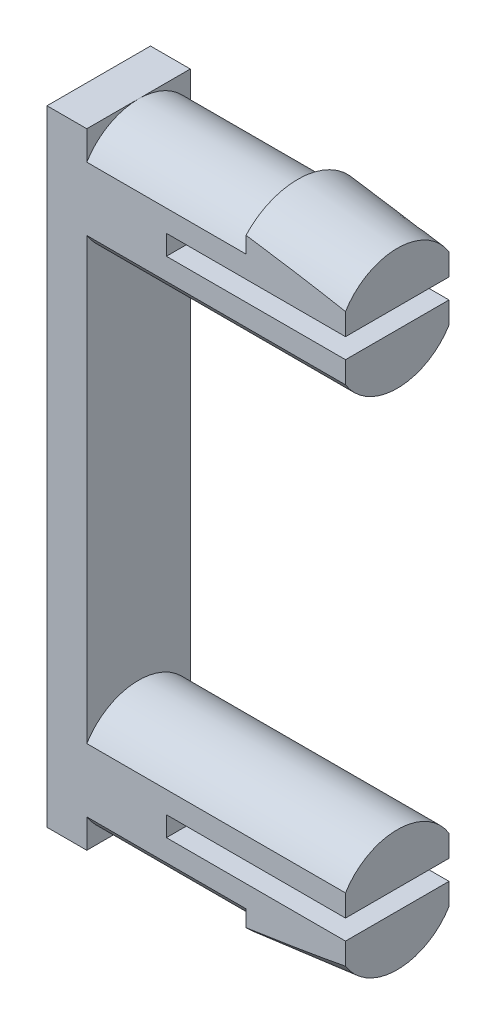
ISO-10303-21;
HEADER;
FILE_DESCRIPTION(('STEP AP214'),'2;1');
FILE_NAME('part.step','',(''),(''),'','','');
FILE_SCHEMA(('AUTOMOTIVE_DESIGN { 1 0 10303 214 1 1 1 1 }'));
ENDSEC;
DATA;
#1=APPLICATION_CONTEXT('core data for automotive mechanical design processes');
#2=APPLICATION_PROTOCOL_DEFINITION('international standard','automotive_design',2000,#1);
#3=PRODUCT_CONTEXT('',#1,'mechanical');
#4=PRODUCT('Part','Part','',(#3));
#5=PRODUCT_RELATED_PRODUCT_CATEGORY('part','',(#4));
#6=PRODUCT_DEFINITION_FORMATION('','',#4);
#7=PRODUCT_DEFINITION_CONTEXT('part definition',#1,'design');
#8=PRODUCT_DEFINITION('design','',#6,#7);
#9=PRODUCT_DEFINITION_SHAPE('','',#8);
#10=(LENGTH_UNIT() NAMED_UNIT(*) SI_UNIT(.MILLI.,.METRE.));
#11=(NAMED_UNIT(*) PLANE_ANGLE_UNIT() SI_UNIT($,.RADIAN.));
#12=(NAMED_UNIT(*) SI_UNIT($,.STERADIAN.) SOLID_ANGLE_UNIT());
#13=UNCERTAINTY_MEASURE_WITH_UNIT(LENGTH_MEASURE(1.E-05),#10,'distance_accuracy_value','');
#14=(GEOMETRIC_REPRESENTATION_CONTEXT(3) GLOBAL_UNCERTAINTY_ASSIGNED_CONTEXT((#13)) GLOBAL_UNIT_ASSIGNED_CONTEXT((#10,
#11,#12)) REPRESENTATION_CONTEXT('',''));
#15=CARTESIAN_POINT('',(0.,0.,0.));
#16=DIRECTION('',(0.,0.,1.));
#17=DIRECTION('',(1.,0.,0.));
#18=AXIS2_PLACEMENT_3D('',#15,#16,#17);
#19=CARTESIAN_POINT('',(14.,-12.65,12.65));
#20=DIRECTION('',(1.,0.,0.));
#21=DIRECTION('',(0.,1.,0.));
#22=AXIS2_PLACEMENT_3D('',#19,#20,#21);
#23=PLANE('',#22);
#24=DIRECTION('',(0.,0.,-1.));
#25=VECTOR('',#24,1.);
#26=CARTESIAN_POINT('',(14.,-12.15,2.60100000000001));
#27=LINE('',#26,#25);
#28=CARTESIAN_POINT('',(14.,-12.15,2.59999999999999));
#29=VERTEX_POINT('',#28);
#30=CARTESIAN_POINT('',(14.,-12.15,-2.59999999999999));
#31=VERTEX_POINT('',#30);
#32=EDGE_CURVE('E211',#29,#31,#27,.T.);
#33=ORIENTED_EDGE('',*,*,#32,.T.);
#34=DIRECTION('',(0.,-1.,0.));
#35=VECTOR('',#34,1.);
#36=CARTESIAN_POINT('',(14.,0.,-2.6));
#37=LINE('',#36,#35);
#38=CARTESIAN_POINT('',(14.,-11.0554781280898,-2.59999999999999));
#39=VERTEX_POINT('',#38);
#40=EDGE_CURVE('E389',#39,#31,#37,.T.);
#41=ORIENTED_EDGE('',*,*,#40,.F.);
#42=CARTESIAN_POINT('',(14.,-12.65,0.));
#43=DIRECTION('',(-1.,0.,0.));
#44=DIRECTION('',(0.,-1.,0.));
#45=AXIS2_PLACEMENT_3D('',#42,#43,#44);
#46=CIRCLE('',#45,3.05);
#47=CARTESIAN_POINT('',(14.,-11.0554781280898,2.59999999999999));
#48=VERTEX_POINT('',#47);
#49=EDGE_CURVE('E330',#48,#39,#46,.T.);
#50=ORIENTED_EDGE('',*,*,#49,.F.);
#51=DIRECTION('',(0.,-1.,0.));
#52=VECTOR('',#51,1.);
#53=CARTESIAN_POINT('',(14.,0.,2.6));
#54=LINE('',#53,#52);
#55=EDGE_CURVE('E226',#48,#29,#54,.T.);
#56=ORIENTED_EDGE('',*,*,#55,.T.);
#57=EDGE_LOOP('',(#33,#41,#50,#56));
#58=FACE_BOUND('',#57,.T.);
#59=ADVANCED_FACE('F37',(#58),#23,.T.);
#60=CARTESIAN_POINT('',(14.,12.65,-12.65));
#61=DIRECTION('',(1.,0.,0.));
#62=DIRECTION('',(0.,1.,0.));
#63=AXIS2_PLACEMENT_3D('',#60,#61,#62);
#64=PLANE('',#63);
#65=DIRECTION('',(0.,0.,-1.));
#66=VECTOR('',#65,1.);
#67=CARTESIAN_POINT('',(14.,13.15,2.601));
#68=LINE('',#67,#66);
#69=CARTESIAN_POINT('',(14.,13.15,2.6));
#70=VERTEX_POINT('',#69);
#71=CARTESIAN_POINT('',(14.,13.15,-2.6));
#72=VERTEX_POINT('',#71);
#73=EDGE_CURVE('E434',#70,#72,#68,.T.);
#74=ORIENTED_EDGE('',*,*,#73,.T.);
#75=CARTESIAN_POINT('',(14.,14.2445218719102,-2.6));
#76=VERTEX_POINT('',#75);
#77=EDGE_CURVE('E382',#76,#72,#37,.T.);
#78=ORIENTED_EDGE('',*,*,#77,.F.);
#79=CARTESIAN_POINT('',(14.,12.65,0.));
#80=DIRECTION('',(-1.,0.,0.));
#81=DIRECTION('',(0.,-1.,0.));
#82=AXIS2_PLACEMENT_3D('',#79,#80,#81);
#83=CIRCLE('',#82,3.05);
#84=CARTESIAN_POINT('',(14.,14.2445218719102,2.6));
#85=VERTEX_POINT('',#84);
#86=EDGE_CURVE('E320',#85,#76,#83,.T.);
#87=ORIENTED_EDGE('',*,*,#86,.F.);
#88=EDGE_CURVE('E231',#85,#70,#54,.T.);
#89=ORIENTED_EDGE('',*,*,#88,.T.);
#90=EDGE_LOOP('',(#74,#78,#87,#89));
#91=FACE_BOUND('',#90,.T.);
#92=ADVANCED_FACE('F498',(#91),#64,.T.);
#93=CARTESIAN_POINT('',(0.999999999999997,12.65,0.));
#94=DIRECTION('',(-1.,0.,0.));
#95=DIRECTION('',(0.,-1.,0.));
#96=AXIS2_PLACEMENT_3D('',#93,#94,#95);
#97=CYLINDRICAL_SURFACE('',#96,3.05);
#98=DIRECTION('',(-1.,0.,0.));
#99=VECTOR('',#98,1.);
#100=CARTESIAN_POINT('',(0.999999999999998,11.0554781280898,2.6));
#101=LINE('',#100,#99);
#102=CARTESIAN_POINT('',(0.999999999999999,11.0554781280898,2.6));
#103=VERTEX_POINT('',#102);
#104=CARTESIAN_POINT('',(14.,11.0554781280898,2.6));
#105=VERTEX_POINT('',#104);
#106=EDGE_CURVE('E388',#103,#105,#101,.F.);
#107=ORIENTED_EDGE('',*,*,#106,.F.);
#108=CARTESIAN_POINT('',(0.999999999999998,12.65,0.));
#109=DIRECTION('',(-1.,0.,0.));
#110=DIRECTION('',(0.,-1.,0.));
#111=AXIS2_PLACEMENT_3D('',#108,#109,#110);
#112=CIRCLE('',#111,3.05);
#113=CARTESIAN_POINT('',(0.999999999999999,11.0554781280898,-2.6));
#114=VERTEX_POINT('',#113);
#115=EDGE_CURVE('E324',#114,#103,#112,.T.);
#116=ORIENTED_EDGE('',*,*,#115,.F.);
#117=DIRECTION('',(-1.,0.,0.));
#118=VECTOR('',#117,1.);
#119=CARTESIAN_POINT('',(0.999999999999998,11.0554781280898,-2.6));
#120=LINE('',#119,#118);
#121=CARTESIAN_POINT('',(14.,11.0554781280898,-2.6));
#122=VERTEX_POINT('',#121);
#123=EDGE_CURVE('E361',#114,#122,#120,.F.);
#124=ORIENTED_EDGE('',*,*,#123,.T.);
#125=CARTESIAN_POINT('',(14.,12.65,0.));
#126=DIRECTION('',(-1.,0.,0.));
#127=DIRECTION('',(0.,-1.,0.));
#128=AXIS2_PLACEMENT_3D('',#125,#126,#127);
#129=CIRCLE('',#128,3.05);
#130=EDGE_CURVE('E327',#122,#105,#129,.T.);
#131=ORIENTED_EDGE('',*,*,#130,.T.);
#132=EDGE_LOOP('',(#107,#116,#124,#131));
#133=FACE_BOUND('',#132,.T.);
#134=ADVANCED_FACE('F446',(#133),#97,.T.);
#135=CARTESIAN_POINT('',(1.,-12.65,0.));
#136=DIRECTION('',(-1.,0.,0.));
#137=DIRECTION('',(0.,-1.,0.));
#138=AXIS2_PLACEMENT_3D('',#135,#136,#137);
#139=CYLINDRICAL_SURFACE('',#138,3.05);
#140=DIRECTION('',(-1.,0.,0.));
#141=VECTOR('',#140,1.);
#142=CARTESIAN_POINT('',(1.,-14.2445218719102,2.59999999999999));
#143=LINE('',#142,#141);
#144=CARTESIAN_POINT('',(1.,-14.2445218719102,2.59999999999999));
#145=VERTEX_POINT('',#144);
#146=CARTESIAN_POINT('',(9.,-14.2445218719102,2.59999999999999));
#147=VERTEX_POINT('',#146);
#148=EDGE_CURVE('E801',#145,#147,#143,.F.);
#149=ORIENTED_EDGE('',*,*,#148,.F.);
#150=CARTESIAN_POINT('',(1.,-12.65,0.));
#151=DIRECTION('',(-1.,0.,0.));
#152=DIRECTION('',(0.,-1.,0.));
#153=AXIS2_PLACEMENT_3D('',#150,#151,#152);
#154=CIRCLE('',#153,3.05);
#155=CARTESIAN_POINT('',(1.,-15.7,0.));
#156=VERTEX_POINT('',#155);
#157=EDGE_CURVE('E340',#156,#145,#154,.T.);
#158=ORIENTED_EDGE('',*,*,#157,.F.);
#159=CARTESIAN_POINT('',(1.,-14.2445218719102,-2.59999999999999));
#160=VERTEX_POINT('',#159);
#161=EDGE_CURVE('E339',#160,#156,#154,.T.);
#162=ORIENTED_EDGE('',*,*,#161,.F.);
#163=DIRECTION('',(-1.,0.,0.));
#164=VECTOR('',#163,1.);
#165=CARTESIAN_POINT('',(1.,-14.2445218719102,-2.59999999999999));
#166=LINE('',#165,#164);
#167=CARTESIAN_POINT('',(9.,-14.2445218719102,-2.59999999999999));
#168=VERTEX_POINT('',#167);
#169=EDGE_CURVE('E373',#160,#168,#166,.F.);
#170=ORIENTED_EDGE('',*,*,#169,.T.);
#171=CARTESIAN_POINT('',(9.,-12.65,0.));
#172=DIRECTION('',(-1.,0.,0.));
#173=DIRECTION('',(0.,-1.,0.));
#174=AXIS2_PLACEMENT_3D('',#171,#172,#173);
#175=CIRCLE('',#174,3.05);
#176=EDGE_CURVE('E343',#168,#147,#175,.T.);
#177=ORIENTED_EDGE('',*,*,#176,.T.);
#178=EDGE_LOOP('',(#149,#158,#162,#170,#177));
#179=FACE_BOUND('',#178,.T.);
#180=ADVANCED_FACE('F460',(#179),#139,.T.);
#181=CARTESIAN_POINT('',(1.,0.,3.));
#182=DIRECTION('',(1.,0.,0.));
#183=DIRECTION('',(0.,1.,0.));
#184=AXIS2_PLACEMENT_3D('',#181,#182,#183);
#185=PLANE('',#184);
#186=DIRECTION('',(0.,0.,-1.));
#187=VECTOR('',#186,1.);
#188=CARTESIAN_POINT('',(1.,-15.7,3.));
#189=LINE('',#188,#187);
#190=CARTESIAN_POINT('',(1.,-15.7,-2.6));
#191=VERTEX_POINT('',#190);
#192=EDGE_CURVE('E315',#156,#191,#189,.T.);
#193=ORIENTED_EDGE('',*,*,#192,.T.);
#194=DIRECTION('',(0.,1.,0.));
#195=VECTOR('',#194,1.);
#196=CARTESIAN_POINT('',(1.,0.,-2.6));
#197=LINE('',#196,#195);
#198=EDGE_CURVE('E370',#191,#160,#197,.T.);
#199=ORIENTED_EDGE('',*,*,#198,.T.);
#200=ORIENTED_EDGE('',*,*,#161,.T.);
#201=EDGE_LOOP('',(#193,#199,#200));
#202=FACE_BOUND('',#201,.T.);
#203=ADVANCED_FACE('F39',(#202),#185,.T.);
#204=DIRECTION('',(0.,1.,0.));
#205=VECTOR('',#204,1.);
#206=CARTESIAN_POINT('',(1.,0.,2.6));
#207=LINE('',#206,#205);
#208=CARTESIAN_POINT('',(1.,-11.0554781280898,2.59999999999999));
#209=VERTEX_POINT('',#208);
#210=EDGE_CURVE('E393',#209,#103,#207,.T.);
#211=ORIENTED_EDGE('',*,*,#210,.F.);
#212=CARTESIAN_POINT('',(1.,-12.65,0.));
#213=DIRECTION('',(-1.,0.,0.));
#214=DIRECTION('',(0.,-1.,0.));
#215=AXIS2_PLACEMENT_3D('',#212,#213,#214);
#216=CIRCLE('',#215,3.05);
#217=CARTESIAN_POINT('',(1.,-11.0554781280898,-2.59999999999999));
#218=VERTEX_POINT('',#217);
#219=EDGE_CURVE('E332',#209,#218,#216,.T.);
#220=ORIENTED_EDGE('',*,*,#219,.T.);
#221=DIRECTION('',(0.,1.,0.));
#222=VECTOR('',#221,1.);
#223=CARTESIAN_POINT('',(1.,0.,-2.6));
#224=LINE('',#223,#222);
#225=EDGE_CURVE('E364',#218,#114,#224,.T.);
#226=ORIENTED_EDGE('',*,*,#225,.T.);
#227=ORIENTED_EDGE('',*,*,#115,.T.);
#228=EDGE_LOOP('',(#211,#220,#226,#227));
#229=FACE_BOUND('',#228,.T.);
#230=ADVANCED_FACE('F402',(#229),#185,.T.);
#231=CARTESIAN_POINT('',(0.999999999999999,12.65,0.));
#232=DIRECTION('',(-1.,0.,0.));
#233=DIRECTION('',(0.,-1.,0.));
#234=AXIS2_PLACEMENT_3D('',#231,#232,#233);
#235=CIRCLE('',#234,3.05);
#236=CARTESIAN_POINT('',(0.999999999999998,15.7,0.));
#237=VERTEX_POINT('',#236);
#238=CARTESIAN_POINT('',(0.999999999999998,14.2445218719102,-2.6));
#239=VERTEX_POINT('',#238);
#240=EDGE_CURVE('E307',#237,#239,#235,.T.);
#241=ORIENTED_EDGE('',*,*,#240,.T.);
#242=DIRECTION('',(0.,1.,0.));
#243=VECTOR('',#242,1.);
#244=CARTESIAN_POINT('',(1.,0.,-2.6));
#245=LINE('',#244,#243);
#246=CARTESIAN_POINT('',(0.999999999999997,15.7,-2.6));
#247=VERTEX_POINT('',#246);
#248=EDGE_CURVE('E346',#239,#247,#245,.T.);
#249=ORIENTED_EDGE('',*,*,#248,.T.);
#250=DIRECTION('',(0.,0.,-1.));
#251=VECTOR('',#250,1.);
#252=CARTESIAN_POINT('',(0.999999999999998,15.7,3.));
#253=LINE('',#252,#251);
#254=EDGE_CURVE('E308',#237,#247,#253,.T.);
#255=ORIENTED_EDGE('',*,*,#254,.F.);
#256=EDGE_LOOP('',(#241,#249,#255));
#257=FACE_BOUND('',#256,.T.);
#258=ADVANCED_FACE('F483',(#257),#185,.T.);
#259=CARTESIAN_POINT('',(0.,15.7,3.));
#260=DIRECTION('',(0.,1.,0.));
#261=DIRECTION('',(0.,0.,1.));
#262=AXIS2_PLACEMENT_3D('',#259,#260,#261);
#263=PLANE('',#262);
#264=DIRECTION('',(-1.,0.,0.));
#265=VECTOR('',#264,1.);
#266=CARTESIAN_POINT('',(14.,15.7,2.6));
#267=LINE('',#266,#265);
#268=CARTESIAN_POINT('',(0.999999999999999,15.7,2.6));
#269=VERTEX_POINT('',#268);
#270=CARTESIAN_POINT('',(-1.,15.7,2.6));
#271=VERTEX_POINT('',#270);
#272=EDGE_CURVE('E241',#269,#271,#267,.T.);
#273=ORIENTED_EDGE('',*,*,#272,.F.);
#274=EDGE_CURVE('E305',#269,#237,#253,.T.);
#275=ORIENTED_EDGE('',*,*,#274,.T.);
#276=ORIENTED_EDGE('',*,*,#254,.T.);
#277=DIRECTION('',(-1.,0.,0.));
#278=VECTOR('',#277,1.);
#279=CARTESIAN_POINT('',(14.,15.7,-2.6));
#280=LINE('',#279,#278);
#281=CARTESIAN_POINT('',(-1.,15.7,-2.6));
#282=VERTEX_POINT('',#281);
#283=EDGE_CURVE('E379',#247,#282,#280,.T.);
#284=ORIENTED_EDGE('',*,*,#283,.T.);
#285=DIRECTION('',(0.,0.,-1.));
#286=VECTOR('',#285,1.);
#287=CARTESIAN_POINT('',(-1.,15.7,3.));
#288=LINE('',#287,#286);
#289=EDGE_CURVE('E309',#271,#282,#288,.T.);
#290=ORIENTED_EDGE('',*,*,#289,.F.);
#291=EDGE_LOOP('',(#273,#275,#276,#284,#290));
#292=FACE_BOUND('',#291,.T.);
#293=ADVANCED_FACE('F476',(#292),#263,.T.);
#294=CARTESIAN_POINT('',(-1.,0.,3.));
#295=DIRECTION('',(1.,0.,0.));
#296=DIRECTION('',(0.,1.,0.));
#297=AXIS2_PLACEMENT_3D('',#294,#295,#296);
#298=PLANE('',#297);
#299=DIRECTION('',(0.,0.,-1.));
#300=VECTOR('',#299,1.);
#301=CARTESIAN_POINT('',(-0.999999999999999,-15.7,3.));
#302=LINE('',#301,#300);
#303=CARTESIAN_POINT('',(-0.999999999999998,-15.7,2.6));
#304=VERTEX_POINT('',#303);
#305=CARTESIAN_POINT('',(-0.999999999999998,-15.7,-2.6));
#306=VERTEX_POINT('',#305);
#307=EDGE_CURVE('E311',#304,#306,#302,.T.);
#308=ORIENTED_EDGE('',*,*,#307,.F.);
#309=DIRECTION('',(0.,-1.,0.));
#310=VECTOR('',#309,1.);
#311=CARTESIAN_POINT('',(-1.,0.,2.6));
#312=LINE('',#311,#310);
#313=EDGE_CURVE('E227',#271,#304,#312,.T.);
#314=ORIENTED_EDGE('',*,*,#313,.F.);
#315=ORIENTED_EDGE('',*,*,#289,.T.);
#316=DIRECTION('',(0.,-1.,0.));
#317=VECTOR('',#316,1.);
#318=CARTESIAN_POINT('',(-1.,0.,-2.6));
#319=LINE('',#318,#317);
#320=EDGE_CURVE('E385',#282,#306,#319,.T.);
#321=ORIENTED_EDGE('',*,*,#320,.T.);
#322=EDGE_LOOP('',(#308,#314,#315,#321));
#323=FACE_BOUND('',#322,.T.);
#324=ADVANCED_FACE('F473',(#323),#298,.F.);
#325=CARTESIAN_POINT('',(0.,-15.7,3.));
#326=DIRECTION('',(0.,1.,0.));
#327=DIRECTION('',(0.,0.,1.));
#328=AXIS2_PLACEMENT_3D('',#325,#326,#327);
#329=PLANE('',#328);
#330=CARTESIAN_POINT('',(1.,-15.7,2.6));
#331=VERTEX_POINT('',#330);
#332=EDGE_CURVE('E313',#331,#156,#189,.T.);
#333=ORIENTED_EDGE('',*,*,#332,.F.);
#334=DIRECTION('',(-1.,0.,0.));
#335=VECTOR('',#334,1.);
#336=CARTESIAN_POINT('',(14.,-15.7,2.6));
#337=LINE('',#336,#335);
#338=EDGE_CURVE('E245',#331,#304,#337,.T.);
#339=ORIENTED_EDGE('',*,*,#338,.T.);
#340=ORIENTED_EDGE('',*,*,#307,.T.);
#341=DIRECTION('',(-1.,0.,0.));
#342=VECTOR('',#341,1.);
#343=CARTESIAN_POINT('',(14.,-15.7,-2.6));
#344=LINE('',#343,#342);
#345=EDGE_CURVE('E378',#191,#306,#344,.T.);
#346=ORIENTED_EDGE('',*,*,#345,.F.);
#347=ORIENTED_EDGE('',*,*,#192,.F.);
#348=EDGE_LOOP('',(#333,#339,#340,#346,#347));
#349=FACE_BOUND('',#348,.T.);
#350=ADVANCED_FACE('F469',(#349),#329,.F.);
#351=CARTESIAN_POINT('',(14.,12.65,0.));
#352=DIRECTION('',(-1.,0.,0.));
#353=DIRECTION('',(0.,-1.,0.));
#354=AXIS2_PLACEMENT_3D('',#351,#352,#353);
#355=CONICAL_SURFACE('',#354,3.05,0.0996686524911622);
#356=CARTESIAN_POINT('',(9.,12.65,0.));
#357=DIRECTION('',(-1.,0.,0.));
#358=DIRECTION('',(0.,-1.,0.));
#359=AXIS2_PLACEMENT_3D('',#356,#357,#358);
#360=CIRCLE('',#359,3.55);
#361=CARTESIAN_POINT('',(9.,15.0671263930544,2.6));
#362=VERTEX_POINT('',#361);
#363=CARTESIAN_POINT('',(9.,15.0671263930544,-2.6));
#364=VERTEX_POINT('',#363);
#365=EDGE_CURVE('E316',#362,#364,#360,.T.);
#366=ORIENTED_EDGE('',*,*,#365,.F.);
#367=CARTESIAN_POINT('',(3.3466784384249,15.8399778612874,2.6));
#368=CARTESIAN_POINT('',(3.86986850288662,15.7724583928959,2.6));
#369=CARTESIAN_POINT('',(4.39295767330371,15.7041418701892,2.6));
#370=CARTESIAN_POINT('',(5.43889452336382,15.5654440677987,2.6));
#371=CARTESIAN_POINT('',(5.96174218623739,15.4950626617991,2.6));
#372=CARTESIAN_POINT('',(7.0091988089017,15.3514838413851,2.6));
#373=CARTESIAN_POINT('',(7.53380637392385,15.2782762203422,2.6));
#374=CARTESIAN_POINT('',(8.58253516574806,15.1286090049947,2.6));
#375=CARTESIAN_POINT('',(9.1066564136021,15.0521495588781,2.6));
#376=CARTESIAN_POINT('',(10.1541460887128,14.8949524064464,2.6));
#377=CARTESIAN_POINT('',(10.6775146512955,14.8142156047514,2.6));
#378=CARTESIAN_POINT('',(11.7233907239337,14.6468412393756,2.6));
#379=CARTESIAN_POINT('',(12.2458981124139,14.5602029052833,2.6));
#380=CARTESIAN_POINT('',(13.027882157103,14.4237827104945,2.6));
#381=CARTESIAN_POINT('',(13.2879322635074,14.3772926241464,2.6));
#382=CARTESIAN_POINT('',(13.8075192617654,14.2815362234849,2.6));
#383=CARTESIAN_POINT('',(14.0670561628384,14.2322699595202,2.6));
#384=CARTESIAN_POINT('',(14.5853771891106,14.1301291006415,2.6));
#385=CARTESIAN_POINT('',(14.8441614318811,14.0772551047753,2.6));
#386=CARTESIAN_POINT('',(15.3606719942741,13.9665954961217,2.6));
#387=CARTESIAN_POINT('',(15.6183984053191,13.9088103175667,2.6));
#388=CARTESIAN_POINT('',(16.0038716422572,13.8166457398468,2.6));
#389=CARTESIAN_POINT('',(16.1322669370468,13.7849854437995,2.6));
#390=CARTESIAN_POINT('',(16.3884479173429,13.719350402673,2.6));
#391=CARTESIAN_POINT('',(16.5162336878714,13.6853759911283,2.6));
#392=CARTESIAN_POINT('',(16.7711235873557,13.6143703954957,2.6));
#393=CARTESIAN_POINT('',(16.8982267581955,13.5773357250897,2.6));
#394=CARTESIAN_POINT('',(17.0879458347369,13.5186477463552,2.6));
#395=CARTESIAN_POINT('',(17.1510440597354,13.4985574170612,2.6));
#396=CARTESIAN_POINT('',(17.2768250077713,13.4570919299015,2.6));
#397=CARTESIAN_POINT('',(17.3395076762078,13.435716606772,2.6));
#398=CARTESIAN_POINT('',(17.4019276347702,13.4135805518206,2.6));
#399=B_SPLINE_CURVE_WITH_KNOTS('',3,(#367,#368,#369,#370,#371,#372,#373,#374,#375,#376,#377,
#378,#379,#380,#381,#382,#383,#384,#385,#386,#387,#388,#389,#390,#391,#392,#393,#394,#395,#396,
#397,#398),.UNSPECIFIED.,.F.,.F.,(4,2,2,2,2,2,2,2,2,2,2,2,2,2,2,4),(0.,1.58258898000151,
3.1652749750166,4.75434001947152,6.34333272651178,7.93199070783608,9.52085647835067,
10.3133647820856,11.1058587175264,11.8982213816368,12.6905140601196,13.087221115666,
13.4838711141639,13.8809793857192,14.0796253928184,14.2782970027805),.UNSPECIFIED.);
#400=EDGE_CURVE('E257',#362,#85,#399,.T.);
#401=ORIENTED_EDGE('',*,*,#400,.T.);
#402=ORIENTED_EDGE('',*,*,#86,.T.);
#403=CARTESIAN_POINT('',(3.3466784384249,15.8399778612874,-2.6));
#404=CARTESIAN_POINT('',(3.86986850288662,15.7724583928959,-2.6));
#405=CARTESIAN_POINT('',(4.39295767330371,15.7041418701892,-2.6));
#406=CARTESIAN_POINT('',(5.43889452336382,15.5654440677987,-2.6));
#407=CARTESIAN_POINT('',(5.96174218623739,15.4950626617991,-2.6));
#408=CARTESIAN_POINT('',(7.0091988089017,15.3514838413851,-2.6));
#409=CARTESIAN_POINT('',(7.53380637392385,15.2782762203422,-2.6));
#410=CARTESIAN_POINT('',(8.58253516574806,15.1286090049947,-2.6));
#411=CARTESIAN_POINT('',(9.1066564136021,15.0521495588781,-2.6));
#412=CARTESIAN_POINT('',(10.1541460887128,14.8949524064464,-2.6));
#413=CARTESIAN_POINT('',(10.6775146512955,14.8142156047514,-2.6));
#414=CARTESIAN_POINT('',(11.7233907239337,14.6468412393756,-2.6));
#415=CARTESIAN_POINT('',(12.2458981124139,14.5602029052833,-2.6));
#416=CARTESIAN_POINT('',(13.027882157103,14.4237827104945,-2.6));
#417=CARTESIAN_POINT('',(13.2879322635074,14.3772926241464,-2.6));
#418=CARTESIAN_POINT('',(13.8075192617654,14.2815362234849,-2.6));
#419=CARTESIAN_POINT('',(14.0670561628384,14.2322699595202,-2.6));
#420=CARTESIAN_POINT('',(14.5853771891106,14.1301291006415,-2.6));
#421=CARTESIAN_POINT('',(14.8441614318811,14.0772551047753,-2.6));
#422=CARTESIAN_POINT('',(15.3606719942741,13.9665954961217,-2.6));
#423=CARTESIAN_POINT('',(15.6183984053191,13.9088103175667,-2.6));
#424=CARTESIAN_POINT('',(16.0038716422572,13.8166457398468,-2.6));
#425=CARTESIAN_POINT('',(16.1322669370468,13.7849854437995,-2.6));
#426=CARTESIAN_POINT('',(16.3884479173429,13.719350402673,-2.6));
#427=CARTESIAN_POINT('',(16.5162336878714,13.6853759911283,-2.6));
#428=CARTESIAN_POINT('',(16.7711235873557,13.6143703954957,-2.6));
#429=CARTESIAN_POINT('',(16.8982267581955,13.5773357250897,-2.6));
#430=CARTESIAN_POINT('',(17.0879458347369,13.5186477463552,-2.6));
#431=CARTESIAN_POINT('',(17.1510440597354,13.4985574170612,-2.6));
#432=CARTESIAN_POINT('',(17.2768250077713,13.4570919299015,-2.6));
#433=CARTESIAN_POINT('',(17.3395076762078,13.435716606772,-2.6));
#434=CARTESIAN_POINT('',(17.4019276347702,13.4135805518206,-2.6));
#435=B_SPLINE_CURVE_WITH_KNOTS('',3,(#403,#404,#405,#406,#407,#408,#409,#410,#411,#412,#413,
#414,#415,#416,#417,#418,#419,#420,#421,#422,#423,#424,#425,#426,#427,#428,#429,#430,#431,#432,
#433,#434),.UNSPECIFIED.,.F.,.F.,(4,2,2,2,2,2,2,2,2,2,2,2,2,2,2,4),(0.,1.58258898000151,
3.1652749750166,4.75434001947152,6.34333272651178,7.93199070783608,9.52085647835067,
10.3133647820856,11.1058587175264,11.8982213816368,12.6905140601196,13.087221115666,
13.4838711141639,13.8809793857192,14.0796253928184,14.2782970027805),.UNSPECIFIED.);
#436=EDGE_CURVE('E349',#364,#76,#435,.T.);
#437=ORIENTED_EDGE('',*,*,#436,.F.);
#438=EDGE_LOOP('',(#366,#401,#402,#437));
#439=FACE_BOUND('',#438,.T.);
#440=ADVANCED_FACE('F267',(#439),#355,.T.);
#441=CARTESIAN_POINT('',(9.,12.65,-12.65));
#442=DIRECTION('',(1.,0.,0.));
#443=DIRECTION('',(0.,1.,0.));
#444=AXIS2_PLACEMENT_3D('',#441,#442,#443);
#445=PLANE('',#444);
#446=CARTESIAN_POINT('',(9.,12.65,0.));
#447=DIRECTION('',(-1.,0.,0.));
#448=DIRECTION('',(0.,-1.,0.));
#449=AXIS2_PLACEMENT_3D('',#446,#447,#448);
#450=CIRCLE('',#449,3.05);
#451=CARTESIAN_POINT('',(9.,14.2445218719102,2.6));
#452=VERTEX_POINT('',#451);
#453=CARTESIAN_POINT('',(9.,14.2445218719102,-2.6));
#454=VERTEX_POINT('',#453);
#455=EDGE_CURVE('E318',#452,#454,#450,.T.);
#456=ORIENTED_EDGE('',*,*,#455,.F.);
#457=DIRECTION('',(0.,1.,0.));
#458=VECTOR('',#457,1.);
#459=CARTESIAN_POINT('',(9.,12.65,2.6));
#460=LINE('',#459,#458);
#461=EDGE_CURVE('E254',#452,#362,#460,.T.);
#462=ORIENTED_EDGE('',*,*,#461,.T.);
#463=ORIENTED_EDGE('',*,*,#365,.T.);
#464=DIRECTION('',(0.,1.,0.));
#465=VECTOR('',#464,1.);
#466=CARTESIAN_POINT('',(9.,12.65,-2.6));
#467=LINE('',#466,#465);
#468=EDGE_CURVE('E355',#454,#364,#467,.T.);
#469=ORIENTED_EDGE('',*,*,#468,.F.);
#470=EDGE_LOOP('',(#456,#462,#463,#469));
#471=FACE_BOUND('',#470,.T.);
#472=ADVANCED_FACE('F493',(#471),#445,.F.);
#473=DIRECTION('',(-1.,0.,0.));
#474=VECTOR('',#473,1.);
#475=CARTESIAN_POINT('',(0.999999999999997,14.2445218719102,2.6));
#476=LINE('',#475,#474);
#477=CARTESIAN_POINT('',(0.999999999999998,14.2445218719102,2.6));
#478=VERTEX_POINT('',#477);
#479=EDGE_CURVE('E250',#452,#478,#476,.T.);
#480=ORIENTED_EDGE('',*,*,#479,.F.);
#481=ORIENTED_EDGE('',*,*,#455,.T.);
#482=DIRECTION('',(-1.,0.,0.));
#483=VECTOR('',#482,1.);
#484=CARTESIAN_POINT('',(0.999999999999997,14.2445218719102,-2.6));
#485=LINE('',#484,#483);
#486=EDGE_CURVE('E358',#454,#239,#485,.T.);
#487=ORIENTED_EDGE('',*,*,#486,.T.);
#488=ORIENTED_EDGE('',*,*,#240,.F.);
#489=EDGE_CURVE('E304',#478,#237,#235,.T.);
#490=ORIENTED_EDGE('',*,*,#489,.F.);
#491=EDGE_LOOP('',(#480,#481,#487,#488,#490));
#492=FACE_BOUND('',#491,.T.);
#493=ADVANCED_FACE('F488',(#492),#97,.T.);
#494=DIRECTION('',(0.,0.,-1.));
#495=VECTOR('',#494,1.);
#496=CARTESIAN_POINT('',(14.,12.15,2.601));
#497=LINE('',#496,#495);
#498=CARTESIAN_POINT('',(14.,12.15,2.6));
#499=VERTEX_POINT('',#498);
#500=CARTESIAN_POINT('',(14.,12.15,-2.6));
#501=VERTEX_POINT('',#500);
#502=EDGE_CURVE('E433',#499,#501,#497,.T.);
#503=ORIENTED_EDGE('',*,*,#502,.F.);
#504=EDGE_CURVE('E229',#499,#105,#54,.T.);
#505=ORIENTED_EDGE('',*,*,#504,.T.);
#506=ORIENTED_EDGE('',*,*,#130,.F.);
#507=EDGE_CURVE('E392',#501,#122,#37,.T.);
#508=ORIENTED_EDGE('',*,*,#507,.F.);
#509=EDGE_LOOP('',(#503,#505,#506,#508));
#510=FACE_BOUND('',#509,.T.);
#511=ADVANCED_FACE('F444',(#510),#64,.T.);
#512=DIRECTION('',(0.,0.,-1.));
#513=VECTOR('',#512,1.);
#514=CARTESIAN_POINT('',(14.,-13.15,2.60100000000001));
#515=LINE('',#514,#513);
#516=CARTESIAN_POINT('',(14.,-13.15,2.59999999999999));
#517=VERTEX_POINT('',#516);
#518=CARTESIAN_POINT('',(14.,-13.15,-2.59999999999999));
#519=VERTEX_POINT('',#518);
#520=EDGE_CURVE('E206',#517,#519,#515,.T.);
#521=ORIENTED_EDGE('',*,*,#520,.F.);
#522=CARTESIAN_POINT('',(14.,-14.2445218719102,2.59999999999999));
#523=VERTEX_POINT('',#522);
#524=EDGE_CURVE('E217',#517,#523,#54,.T.);
#525=ORIENTED_EDGE('',*,*,#524,.T.);
#526=CARTESIAN_POINT('',(14.,-12.65,0.));
#527=DIRECTION('',(-1.,0.,0.));
#528=DIRECTION('',(0.,-1.,0.));
#529=AXIS2_PLACEMENT_3D('',#526,#527,#528);
#530=CIRCLE('',#529,3.05);
#531=CARTESIAN_POINT('',(14.,-14.2445218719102,-2.59999999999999));
#532=VERTEX_POINT('',#531);
#533=EDGE_CURVE('E337',#532,#523,#530,.T.);
#534=ORIENTED_EDGE('',*,*,#533,.F.);
#535=EDGE_CURVE('E219',#519,#532,#37,.T.);
#536=ORIENTED_EDGE('',*,*,#535,.F.);
#537=EDGE_LOOP('',(#521,#525,#534,#536));
#538=FACE_BOUND('',#537,.T.);
#539=ADVANCED_FACE('F215',(#538),#23,.T.);
#540=DIRECTION('',(-1.,0.,0.));
#541=VECTOR('',#540,1.);
#542=CARTESIAN_POINT('',(1.,-11.0554781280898,2.59999999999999));
#543=LINE('',#542,#541);
#544=EDGE_CURVE('E289',#48,#209,#543,.T.);
#545=ORIENTED_EDGE('',*,*,#544,.F.);
#546=ORIENTED_EDGE('',*,*,#49,.T.);
#547=DIRECTION('',(-1.,0.,0.));
#548=VECTOR('',#547,1.);
#549=CARTESIAN_POINT('',(1.,-11.0554781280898,-2.59999999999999));
#550=LINE('',#549,#548);
#551=EDGE_CURVE('E367',#39,#218,#550,.T.);
#552=ORIENTED_EDGE('',*,*,#551,.T.);
#553=ORIENTED_EDGE('',*,*,#219,.F.);
#554=EDGE_LOOP('',(#545,#546,#552,#553));
#555=FACE_BOUND('',#554,.T.);
#556=ADVANCED_FACE('F405',(#555),#139,.T.);
#557=CARTESIAN_POINT('',(9.,-12.65,12.65));
#558=DIRECTION('',(1.,0.,0.));
#559=DIRECTION('',(0.,1.,0.));
#560=AXIS2_PLACEMENT_3D('',#557,#558,#559);
#561=PLANE('',#560);
#562=CARTESIAN_POINT('',(9.,-12.65,0.));
#563=DIRECTION('',(-1.,0.,0.));
#564=DIRECTION('',(0.,-1.,0.));
#565=AXIS2_PLACEMENT_3D('',#562,#563,#564);
#566=CIRCLE('',#565,3.55);
#567=CARTESIAN_POINT('',(9.00000000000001,-15.0671263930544,-2.59999999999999));
#568=VERTEX_POINT('',#567);
#569=CARTESIAN_POINT('',(9.,-15.0671263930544,2.59999999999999));
#570=VERTEX_POINT('',#569);
#571=EDGE_CURVE('E334',#568,#570,#566,.T.);
#572=ORIENTED_EDGE('',*,*,#571,.T.);
#573=DIRECTION('',(0.,1.,0.));
#574=VECTOR('',#573,1.);
#575=CARTESIAN_POINT('',(9.,-12.65,2.59999999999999));
#576=LINE('',#575,#574);
#577=EDGE_CURVE('E290',#570,#147,#576,.T.);
#578=ORIENTED_EDGE('',*,*,#577,.T.);
#579=ORIENTED_EDGE('',*,*,#176,.F.);
#580=DIRECTION('',(0.,1.,0.));
#581=VECTOR('',#580,1.);
#582=CARTESIAN_POINT('',(9.,-12.6500000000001,-2.59999999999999));
#583=LINE('',#582,#581);
#584=EDGE_CURVE('E376',#568,#168,#583,.T.);
#585=ORIENTED_EDGE('',*,*,#584,.F.);
#586=EDGE_LOOP('',(#572,#578,#579,#585));
#587=FACE_BOUND('',#586,.T.);
#588=ADVANCED_FACE('F297',(#587),#561,.F.);
#589=CARTESIAN_POINT('',(14.,-12.65,0.));
#590=DIRECTION('',(-1.,0.,0.));
#591=DIRECTION('',(0.,-1.,0.));
#592=AXIS2_PLACEMENT_3D('',#589,#590,#591);
#593=CONICAL_SURFACE('',#592,3.05,0.0996686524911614);
#594=ORIENTED_EDGE('',*,*,#533,.T.);
#595=CARTESIAN_POINT('',(3.3466784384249,-15.8399778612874,2.59999999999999));
#596=CARTESIAN_POINT('',(3.86986850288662,-15.7724583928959,2.59999999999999));
#597=CARTESIAN_POINT('',(4.39295767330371,-15.7041418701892,2.59999999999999));
#598=CARTESIAN_POINT('',(5.43889452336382,-15.5654440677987,2.59999999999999));
#599=CARTESIAN_POINT('',(5.9617421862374,-15.4950626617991,2.59999999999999));
#600=CARTESIAN_POINT('',(7.0091988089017,-15.3514838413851,2.59999999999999));
#601=CARTESIAN_POINT('',(7.53380637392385,-15.2782762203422,2.59999999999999));
#602=CARTESIAN_POINT('',(8.58253516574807,-15.1286090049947,2.59999999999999));
#603=CARTESIAN_POINT('',(9.1066564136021,-15.0521495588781,2.59999999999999));
#604=CARTESIAN_POINT('',(10.1541460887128,-14.8949524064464,2.59999999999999));
#605=CARTESIAN_POINT('',(10.6775146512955,-14.8142156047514,2.59999999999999));
#606=CARTESIAN_POINT('',(11.7233907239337,-14.6468412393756,2.59999999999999));
#607=CARTESIAN_POINT('',(12.2458981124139,-14.5602029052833,2.59999999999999));
#608=CARTESIAN_POINT('',(13.0278821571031,-14.4237827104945,2.59999999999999));
#609=CARTESIAN_POINT('',(13.2879322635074,-14.3772926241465,2.59999999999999));
#610=CARTESIAN_POINT('',(13.8075192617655,-14.281536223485,2.59999999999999));
#611=CARTESIAN_POINT('',(14.0670561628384,-14.2322699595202,2.59999999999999));
#612=CARTESIAN_POINT('',(14.5853771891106,-14.1301291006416,2.59999999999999));
#613=CARTESIAN_POINT('',(14.8441614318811,-14.0772551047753,2.59999999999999));
#614=CARTESIAN_POINT('',(15.3606719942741,-13.9665954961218,2.59999999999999));
#615=CARTESIAN_POINT('',(15.6183984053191,-13.9088103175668,2.59999999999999));
#616=CARTESIAN_POINT('',(16.0038716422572,-13.8166457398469,2.59999999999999));
#617=CARTESIAN_POINT('',(16.1322669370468,-13.7849854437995,2.59999999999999));
#618=CARTESIAN_POINT('',(16.3884479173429,-13.719350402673,2.59999999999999));
#619=CARTESIAN_POINT('',(16.5162336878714,-13.6853759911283,2.59999999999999));
#620=CARTESIAN_POINT('',(16.7711235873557,-13.6143703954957,2.59999999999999));
#621=CARTESIAN_POINT('',(16.8982267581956,-13.5773357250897,2.59999999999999));
#622=CARTESIAN_POINT('',(17.0879458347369,-13.5186477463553,2.59999999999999));
#623=CARTESIAN_POINT('',(17.1510440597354,-13.4985574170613,2.59999999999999));
#624=CARTESIAN_POINT('',(17.2768250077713,-13.4570919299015,2.59999999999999));
#625=CARTESIAN_POINT('',(17.3395076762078,-13.435716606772,2.59999999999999));
#626=CARTESIAN_POINT('',(17.4019276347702,-13.4135805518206,2.59999999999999));
#627=B_SPLINE_CURVE_WITH_KNOTS('',3,(#595,#596,#597,#598,#599,#600,#601,#602,#603,#604,#605,
#606,#607,#608,#609,#610,#611,#612,#613,#614,#615,#616,#617,#618,#619,#620,#621,#622,#623,#624,
#625,#626),.UNSPECIFIED.,.F.,.F.,(4,2,2,2,2,2,2,2,2,2,2,2,2,2,2,4),(0.,1.58258898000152,
3.16527497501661,4.75434001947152,6.34333272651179,7.93199070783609,9.52085647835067,
10.3133647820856,11.1058587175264,11.8982213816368,12.6905140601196,13.087221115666,
13.483871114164,13.8809793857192,14.0796253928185,14.2782970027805),.UNSPECIFIED.);
#628=EDGE_CURVE('E224',#523,#570,#627,.F.);
#629=ORIENTED_EDGE('',*,*,#628,.T.);
#630=ORIENTED_EDGE('',*,*,#571,.F.);
#631=CARTESIAN_POINT('',(3.3466784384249,-15.8399778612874,-2.59999999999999));
#632=CARTESIAN_POINT('',(3.86986850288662,-15.7724583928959,-2.59999999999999));
#633=CARTESIAN_POINT('',(4.39295767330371,-15.7041418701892,-2.59999999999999));
#634=CARTESIAN_POINT('',(5.43889452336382,-15.5654440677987,-2.59999999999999));
#635=CARTESIAN_POINT('',(5.9617421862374,-15.4950626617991,-2.59999999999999));
#636=CARTESIAN_POINT('',(7.0091988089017,-15.3514838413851,-2.59999999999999));
#637=CARTESIAN_POINT('',(7.53380637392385,-15.2782762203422,-2.59999999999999));
#638=CARTESIAN_POINT('',(8.58253516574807,-15.1286090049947,-2.59999999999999));
#639=CARTESIAN_POINT('',(9.1066564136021,-15.0521495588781,-2.59999999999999));
#640=CARTESIAN_POINT('',(10.1541460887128,-14.8949524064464,-2.59999999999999));
#641=CARTESIAN_POINT('',(10.6775146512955,-14.8142156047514,-2.59999999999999));
#642=CARTESIAN_POINT('',(11.7233907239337,-14.6468412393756,-2.59999999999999));
#643=CARTESIAN_POINT('',(12.2458981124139,-14.5602029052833,-2.59999999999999));
#644=CARTESIAN_POINT('',(13.0278821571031,-14.4237827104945,-2.59999999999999));
#645=CARTESIAN_POINT('',(13.2879322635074,-14.3772926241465,-2.59999999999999));
#646=CARTESIAN_POINT('',(13.8075192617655,-14.281536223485,-2.59999999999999));
#647=CARTESIAN_POINT('',(14.0670561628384,-14.2322699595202,-2.59999999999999));
#648=CARTESIAN_POINT('',(14.5853771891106,-14.1301291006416,-2.59999999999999));
#649=CARTESIAN_POINT('',(14.8441614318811,-14.0772551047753,-2.59999999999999));
#650=CARTESIAN_POINT('',(15.3606719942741,-13.9665954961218,-2.59999999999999));
#651=CARTESIAN_POINT('',(15.6183984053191,-13.9088103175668,-2.59999999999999));
#652=CARTESIAN_POINT('',(16.0038716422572,-13.8166457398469,-2.59999999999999));
#653=CARTESIAN_POINT('',(16.1322669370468,-13.7849854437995,-2.59999999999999));
#654=CARTESIAN_POINT('',(16.3884479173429,-13.719350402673,-2.59999999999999));
#655=CARTESIAN_POINT('',(16.5162336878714,-13.6853759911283,-2.59999999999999));
#656=CARTESIAN_POINT('',(16.7711235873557,-13.6143703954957,-2.59999999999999));
#657=CARTESIAN_POINT('',(16.8982267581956,-13.5773357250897,-2.59999999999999));
#658=CARTESIAN_POINT('',(17.0879458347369,-13.5186477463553,-2.59999999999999));
#659=CARTESIAN_POINT('',(17.1510440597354,-13.4985574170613,-2.59999999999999));
#660=CARTESIAN_POINT('',(17.2768250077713,-13.4570919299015,-2.59999999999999));
#661=CARTESIAN_POINT('',(17.3395076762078,-13.435716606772,-2.59999999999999));
#662=CARTESIAN_POINT('',(17.4019276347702,-13.4135805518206,-2.59999999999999));
#663=B_SPLINE_CURVE_WITH_KNOTS('',3,(#631,#632,#633,#634,#635,#636,#637,#638,#639,#640,#641,
#642,#643,#644,#645,#646,#647,#648,#649,#650,#651,#652,#653,#654,#655,#656,#657,#658,#659,#660,
#661,#662),.UNSPECIFIED.,.F.,.F.,(4,2,2,2,2,2,2,2,2,2,2,2,2,2,2,4),(0.,1.58258898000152,
3.16527497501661,4.75434001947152,6.34333272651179,7.93199070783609,9.52085647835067,
10.3133647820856,11.1058587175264,11.8982213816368,12.6905140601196,13.087221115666,
13.483871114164,13.8809793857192,14.0796253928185,14.2782970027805),.UNSPECIFIED.);
#664=EDGE_CURVE('E45',#532,#568,#663,.F.);
#665=ORIENTED_EDGE('',*,*,#664,.F.);
#666=EDGE_LOOP('',(#594,#629,#630,#665));
#667=FACE_BOUND('',#666,.T.);
#668=ADVANCED_FACE('F292',(#667),#593,.T.);
#669=DIRECTION('',(0.,1.,0.));
#670=VECTOR('',#669,1.);
#671=CARTESIAN_POINT('',(1.,0.,2.6));
#672=LINE('',#671,#670);
#673=EDGE_CURVE('E265',#331,#145,#672,.T.);
#674=ORIENTED_EDGE('',*,*,#673,.F.);
#675=ORIENTED_EDGE('',*,*,#332,.T.);
#676=ORIENTED_EDGE('',*,*,#157,.T.);
#677=EDGE_LOOP('',(#674,#675,#676));
#678=FACE_BOUND('',#677,.T.);
#679=ADVANCED_FACE('F296',(#678),#185,.T.);
#680=DIRECTION('',(0.,1.,0.));
#681=VECTOR('',#680,1.);
#682=CARTESIAN_POINT('',(1.,0.,2.6));
#683=LINE('',#682,#681);
#684=EDGE_CURVE('E11',#478,#269,#683,.T.);
#685=ORIENTED_EDGE('',*,*,#684,.F.);
#686=ORIENTED_EDGE('',*,*,#489,.T.);
#687=ORIENTED_EDGE('',*,*,#274,.F.);
#688=EDGE_LOOP('',(#685,#686,#687));
#689=FACE_BOUND('',#688,.T.);
#690=ADVANCED_FACE('F503',(#689),#185,.T.);
#691=CARTESIAN_POINT('',(14.,0.,-2.6));
#692=DIRECTION('',(0.,0.,-1.));
#693=DIRECTION('',(0.,1.,0.));
#694=AXIS2_PLACEMENT_3D('',#691,#692,#693);
#695=PLANE('',#694);
#696=DIRECTION('',(1.,0.,0.));
#697=VECTOR('',#696,1.);
#698=CARTESIAN_POINT('',(14.,-12.15,-2.59999999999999));
#699=LINE('',#698,#697);
#700=CARTESIAN_POINT('',(5.,-12.15,-2.59999999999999));
#701=VERTEX_POINT('',#700);
#702=EDGE_CURVE('E220',#701,#31,#699,.T.);
#703=ORIENTED_EDGE('',*,*,#702,.F.);
#704=DIRECTION('',(0.,1.,0.));
#705=VECTOR('',#704,1.);
#706=CARTESIAN_POINT('',(5.,-13.15,-2.59999999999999));
#707=LINE('',#706,#705);
#708=CARTESIAN_POINT('',(5.,-13.15,-2.59999999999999));
#709=VERTEX_POINT('',#708);
#710=EDGE_CURVE('E642',#709,#701,#707,.T.);
#711=ORIENTED_EDGE('',*,*,#710,.F.);
#712=DIRECTION('',(-1.,0.,0.));
#713=VECTOR('',#712,1.);
#714=CARTESIAN_POINT('',(14.,-13.15,-2.59999999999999));
#715=LINE('',#714,#713);
#716=EDGE_CURVE('E452',#519,#709,#715,.T.);
#717=ORIENTED_EDGE('',*,*,#716,.F.);
#718=ORIENTED_EDGE('',*,*,#535,.T.);
#719=ORIENTED_EDGE('',*,*,#664,.T.);
#720=ORIENTED_EDGE('',*,*,#584,.T.);
#721=ORIENTED_EDGE('',*,*,#169,.F.);
#722=ORIENTED_EDGE('',*,*,#198,.F.);
#723=ORIENTED_EDGE('',*,*,#345,.T.);
#724=ORIENTED_EDGE('',*,*,#320,.F.);
#725=ORIENTED_EDGE('',*,*,#283,.F.);
#726=ORIENTED_EDGE('',*,*,#248,.F.);
#727=ORIENTED_EDGE('',*,*,#486,.F.);
#728=ORIENTED_EDGE('',*,*,#468,.T.);
#729=ORIENTED_EDGE('',*,*,#436,.T.);
#730=ORIENTED_EDGE('',*,*,#77,.T.);
#731=DIRECTION('',(1.,0.,0.));
#732=VECTOR('',#731,1.);
#733=CARTESIAN_POINT('',(14.,13.15,-2.6));
#734=LINE('',#733,#732);
#735=CARTESIAN_POINT('',(5.,13.15,-2.6));
#736=VERTEX_POINT('',#735);
#737=EDGE_CURVE('E431',#736,#72,#734,.T.);
#738=ORIENTED_EDGE('',*,*,#737,.F.);
#739=DIRECTION('',(0.,1.,0.));
#740=VECTOR('',#739,1.);
#741=CARTESIAN_POINT('',(5.,12.15,-2.6));
#742=LINE('',#741,#740);
#743=CARTESIAN_POINT('',(5.,12.15,-2.6));
#744=VERTEX_POINT('',#743);
#745=EDGE_CURVE('E428',#744,#736,#742,.T.);
#746=ORIENTED_EDGE('',*,*,#745,.F.);
#747=DIRECTION('',(-1.,0.,0.));
#748=VECTOR('',#747,1.);
#749=CARTESIAN_POINT('',(14.,12.15,-2.6));
#750=LINE('',#749,#748);
#751=EDGE_CURVE('E425',#501,#744,#750,.T.);
#752=ORIENTED_EDGE('',*,*,#751,.F.);
#753=ORIENTED_EDGE('',*,*,#507,.T.);
#754=ORIENTED_EDGE('',*,*,#123,.F.);
#755=ORIENTED_EDGE('',*,*,#225,.F.);
#756=ORIENTED_EDGE('',*,*,#551,.F.);
#757=ORIENTED_EDGE('',*,*,#40,.T.);
#758=EDGE_LOOP('',(#703,#711,#717,#718,#719,#720,#721,#722,#723,#724,#725,#726,#727,#728,#729,
#730,#738,#746,#752,#753,#754,#755,#756,#757));
#759=FACE_BOUND('',#758,.T.);
#760=ADVANCED_FACE('F276',(#759),#695,.T.);
#761=CARTESIAN_POINT('',(14.,0.,2.6));
#762=DIRECTION('',(0.,0.,-1.));
#763=DIRECTION('',(0.,1.,0.));
#764=AXIS2_PLACEMENT_3D('',#761,#762,#763);
#765=PLANE('',#764);
#766=DIRECTION('',(0.,-1.,0.));
#767=VECTOR('',#766,1.);
#768=CARTESIAN_POINT('',(5.,-13.15,2.59999999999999));
#769=LINE('',#768,#767);
#770=CARTESIAN_POINT('',(5.,-12.15,2.59999999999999));
#771=VERTEX_POINT('',#770);
#772=CARTESIAN_POINT('',(5.,-13.15,2.59999999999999));
#773=VERTEX_POINT('',#772);
#774=EDGE_CURVE('E52',#771,#773,#769,.T.);
#775=ORIENTED_EDGE('',*,*,#774,.F.);
#776=DIRECTION('',(-1.,0.,0.));
#777=VECTOR('',#776,1.);
#778=CARTESIAN_POINT('',(14.,-12.15,2.59999999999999));
#779=LINE('',#778,#777);
#780=EDGE_CURVE('E637',#29,#771,#779,.T.);
#781=ORIENTED_EDGE('',*,*,#780,.F.);
#782=ORIENTED_EDGE('',*,*,#55,.F.);
#783=ORIENTED_EDGE('',*,*,#544,.T.);
#784=ORIENTED_EDGE('',*,*,#210,.T.);
#785=ORIENTED_EDGE('',*,*,#106,.T.);
#786=ORIENTED_EDGE('',*,*,#504,.F.);
#787=DIRECTION('',(1.,0.,0.));
#788=VECTOR('',#787,1.);
#789=CARTESIAN_POINT('',(14.,12.15,2.6));
#790=LINE('',#789,#788);
#791=CARTESIAN_POINT('',(5.,12.15,2.6));
#792=VERTEX_POINT('',#791);
#793=EDGE_CURVE('E232',#792,#499,#790,.T.);
#794=ORIENTED_EDGE('',*,*,#793,.F.);
#795=DIRECTION('',(0.,-1.,0.));
#796=VECTOR('',#795,1.);
#797=CARTESIAN_POINT('',(5.,12.15,2.6));
#798=LINE('',#797,#796);
#799=CARTESIAN_POINT('',(5.,13.15,2.6));
#800=VERTEX_POINT('',#799);
#801=EDGE_CURVE('E60',#800,#792,#798,.T.);
#802=ORIENTED_EDGE('',*,*,#801,.F.);
#803=DIRECTION('',(-1.,0.,0.));
#804=VECTOR('',#803,1.);
#805=CARTESIAN_POINT('',(14.,13.15,2.6));
#806=LINE('',#805,#804);
#807=EDGE_CURVE('E422',#70,#800,#806,.T.);
#808=ORIENTED_EDGE('',*,*,#807,.F.);
#809=ORIENTED_EDGE('',*,*,#88,.F.);
#810=ORIENTED_EDGE('',*,*,#400,.F.);
#811=ORIENTED_EDGE('',*,*,#461,.F.);
#812=ORIENTED_EDGE('',*,*,#479,.T.);
#813=ORIENTED_EDGE('',*,*,#684,.T.);
#814=ORIENTED_EDGE('',*,*,#272,.T.);
#815=ORIENTED_EDGE('',*,*,#313,.T.);
#816=ORIENTED_EDGE('',*,*,#338,.F.);
#817=ORIENTED_EDGE('',*,*,#673,.T.);
#818=ORIENTED_EDGE('',*,*,#148,.T.);
#819=ORIENTED_EDGE('',*,*,#577,.F.);
#820=ORIENTED_EDGE('',*,*,#628,.F.);
#821=ORIENTED_EDGE('',*,*,#524,.F.);
#822=DIRECTION('',(1.,0.,0.));
#823=VECTOR('',#822,1.);
#824=CARTESIAN_POINT('',(14.,-13.15,2.59999999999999));
#825=LINE('',#824,#823);
#826=EDGE_CURVE('E202',#773,#517,#825,.T.);
#827=ORIENTED_EDGE('',*,*,#826,.F.);
#828=EDGE_LOOP('',(#775,#781,#782,#783,#784,#785,#786,#794,#802,#808,#809,#810,#811,#812,#813,
#814,#815,#816,#817,#818,#819,#820,#821,#827));
#829=FACE_BOUND('',#828,.T.);
#830=ADVANCED_FACE('F222',(#829),#765,.F.);
#831=CARTESIAN_POINT('',(14.,13.15,2.601));
#832=DIRECTION('',(0.,1.,0.));
#833=DIRECTION('',(0.,0.,1.));
#834=AXIS2_PLACEMENT_3D('',#831,#832,#833);
#835=PLANE('',#834);
#836=ORIENTED_EDGE('',*,*,#807,.T.);
#837=DIRECTION('',(0.,0.,-1.));
#838=VECTOR('',#837,1.);
#839=CARTESIAN_POINT('',(5.,13.15,2.601));
#840=LINE('',#839,#838);
#841=EDGE_CURVE('E436',#800,#736,#840,.T.);
#842=ORIENTED_EDGE('',*,*,#841,.T.);
#843=ORIENTED_EDGE('',*,*,#737,.T.);
#844=ORIENTED_EDGE('',*,*,#73,.F.);
#845=EDGE_LOOP('',(#836,#842,#843,#844));
#846=FACE_BOUND('',#845,.T.);
#847=ADVANCED_FACE('F275',(#846),#835,.F.);
#848=CARTESIAN_POINT('',(5.,12.15,2.601));
#849=DIRECTION('',(-1.,0.,0.));
#850=DIRECTION('',(0.,0.,1.));
#851=AXIS2_PLACEMENT_3D('',#848,#849,#850);
#852=PLANE('',#851);
#853=ORIENTED_EDGE('',*,*,#801,.T.);
#854=DIRECTION('',(0.,0.,-1.));
#855=VECTOR('',#854,1.);
#856=CARTESIAN_POINT('',(5.,12.15,2.601));
#857=LINE('',#856,#855);
#858=EDGE_CURVE('E438',#792,#744,#857,.T.);
#859=ORIENTED_EDGE('',*,*,#858,.T.);
#860=ORIENTED_EDGE('',*,*,#745,.T.);
#861=ORIENTED_EDGE('',*,*,#841,.F.);
#862=EDGE_LOOP('',(#853,#859,#860,#861));
#863=FACE_BOUND('',#862,.T.);
#864=ADVANCED_FACE('F593',(#863),#852,.F.);
#865=CARTESIAN_POINT('',(14.,12.15,2.601));
#866=DIRECTION('',(0.,-1.,0.));
#867=DIRECTION('',(1.,0.,0.));
#868=AXIS2_PLACEMENT_3D('',#865,#866,#867);
#869=PLANE('',#868);
#870=ORIENTED_EDGE('',*,*,#793,.T.);
#871=ORIENTED_EDGE('',*,*,#502,.T.);
#872=ORIENTED_EDGE('',*,*,#751,.T.);
#873=ORIENTED_EDGE('',*,*,#858,.F.);
#874=EDGE_LOOP('',(#870,#871,#872,#873));
#875=FACE_BOUND('',#874,.T.);
#876=ADVANCED_FACE('F277',(#875),#869,.F.);
#877=CARTESIAN_POINT('',(14.,-12.15,2.60100000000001));
#878=DIRECTION('',(0.,1.,0.));
#879=DIRECTION('',(0.,0.,1.));
#880=AXIS2_PLACEMENT_3D('',#877,#878,#879);
#881=PLANE('',#880);
#882=ORIENTED_EDGE('',*,*,#780,.T.);
#883=DIRECTION('',(0.,0.,-1.));
#884=VECTOR('',#883,1.);
#885=CARTESIAN_POINT('',(5.,-12.15,2.60100000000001));
#886=LINE('',#885,#884);
#887=EDGE_CURVE('E414',#771,#701,#886,.T.);
#888=ORIENTED_EDGE('',*,*,#887,.T.);
#889=ORIENTED_EDGE('',*,*,#702,.T.);
#890=ORIENTED_EDGE('',*,*,#32,.F.);
#891=EDGE_LOOP('',(#882,#888,#889,#890));
#892=FACE_BOUND('',#891,.T.);
#893=ADVANCED_FACE('F609',(#892),#881,.F.);
#894=CARTESIAN_POINT('',(5.,-13.15,2.60100000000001));
#895=DIRECTION('',(-1.,0.,0.));
#896=DIRECTION('',(0.,0.,1.));
#897=AXIS2_PLACEMENT_3D('',#894,#895,#896);
#898=PLANE('',#897);
#899=ORIENTED_EDGE('',*,*,#774,.T.);
#900=DIRECTION('',(0.,0.,-1.));
#901=VECTOR('',#900,1.);
#902=CARTESIAN_POINT('',(5.,-13.15,2.60100000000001));
#903=LINE('',#902,#901);
#904=EDGE_CURVE('E208',#773,#709,#903,.T.);
#905=ORIENTED_EDGE('',*,*,#904,.T.);
#906=ORIENTED_EDGE('',*,*,#710,.T.);
#907=ORIENTED_EDGE('',*,*,#887,.F.);
#908=EDGE_LOOP('',(#899,#905,#906,#907));
#909=FACE_BOUND('',#908,.T.);
#910=ADVANCED_FACE('F617',(#909),#898,.F.);
#911=CARTESIAN_POINT('',(14.,-13.15,2.60100000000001));
#912=DIRECTION('',(0.,-1.,0.));
#913=DIRECTION('',(0.,0.,-1.));
#914=AXIS2_PLACEMENT_3D('',#911,#912,#913);
#915=PLANE('',#914);
#916=ORIENTED_EDGE('',*,*,#826,.T.);
#917=ORIENTED_EDGE('',*,*,#520,.T.);
#918=ORIENTED_EDGE('',*,*,#716,.T.);
#919=ORIENTED_EDGE('',*,*,#904,.F.);
#920=EDGE_LOOP('',(#916,#917,#918,#919));
#921=FACE_BOUND('',#920,.T.);
#922=ADVANCED_FACE('F204',(#921),#915,.F.);
#923=CLOSED_SHELL('',(#59,#92,#134,#180,#203,#230,#258,#293,#324,#350,#440,#472,#493,#511,#539,
#556,#588,#668,#679,#690,#760,#830,#847,#864,#876,#893,#910,#922));
#924=MANIFOLD_SOLID_BREP('B2',#923);
#925=ADVANCED_BREP_SHAPE_REPRESENTATION('',(#18,#924),#14);
#926=SHAPE_DEFINITION_REPRESENTATION(#9,#925);
ENDSEC;
END-ISO-10303-21;
